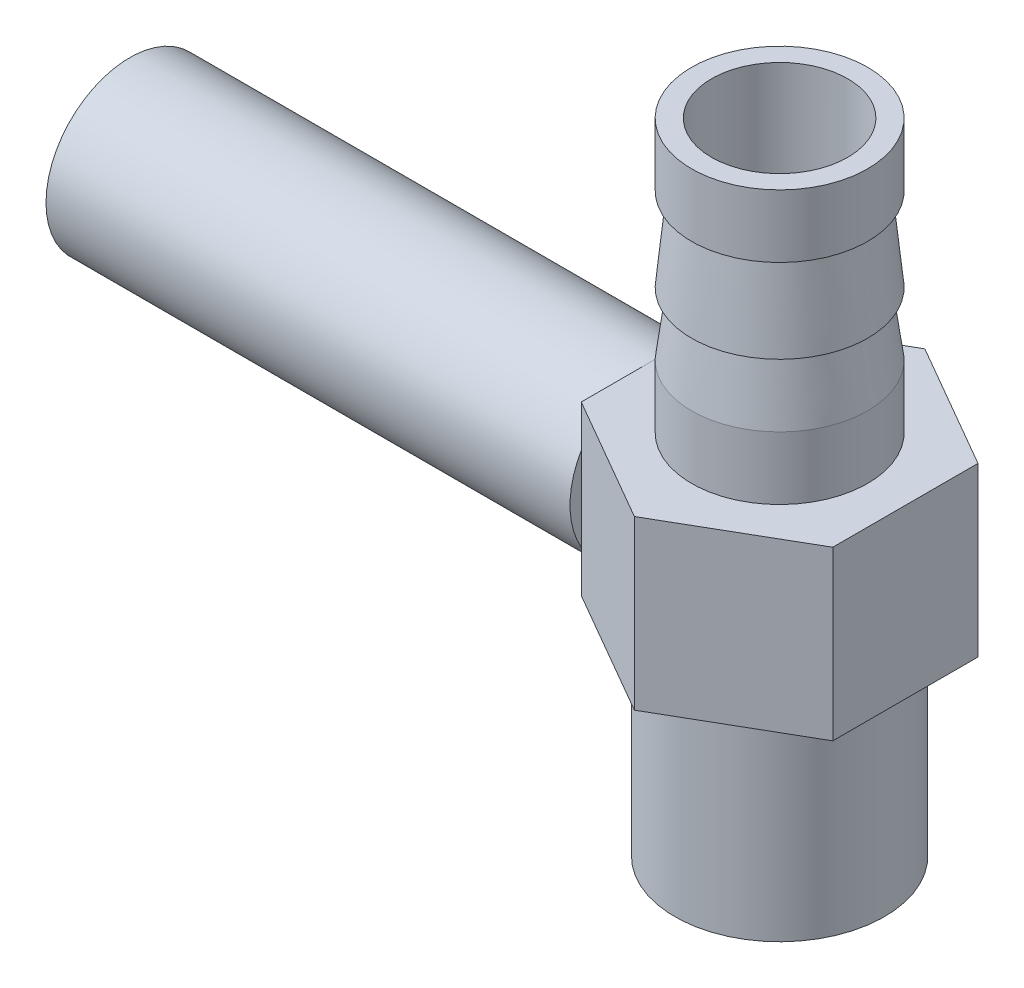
ISO-10303-21;
HEADER;
FILE_DESCRIPTION(('STEP AP214'),'2;1');
FILE_NAME('part.step','',(''),(''),'','','');
FILE_SCHEMA(('AUTOMOTIVE_DESIGN { 1 0 10303 214 1 1 1 1 }'));
ENDSEC;
DATA;
#1=APPLICATION_CONTEXT('core data for automotive mechanical design processes');
#2=APPLICATION_PROTOCOL_DEFINITION('international standard','automotive_design',2000,#1);
#3=PRODUCT_CONTEXT('',#1,'mechanical');
#4=PRODUCT('Part','Part','',(#3));
#5=PRODUCT_RELATED_PRODUCT_CATEGORY('part','',(#4));
#6=PRODUCT_DEFINITION_FORMATION('','',#4);
#7=PRODUCT_DEFINITION_CONTEXT('part definition',#1,'design');
#8=PRODUCT_DEFINITION('design','',#6,#7);
#9=PRODUCT_DEFINITION_SHAPE('','',#8);
#10=(LENGTH_UNIT() NAMED_UNIT(*) SI_UNIT(.MILLI.,.METRE.));
#11=(NAMED_UNIT(*) PLANE_ANGLE_UNIT() SI_UNIT($,.RADIAN.));
#12=(NAMED_UNIT(*) SI_UNIT($,.STERADIAN.) SOLID_ANGLE_UNIT());
#13=UNCERTAINTY_MEASURE_WITH_UNIT(LENGTH_MEASURE(1.E-05),#10,'distance_accuracy_value','');
#14=(GEOMETRIC_REPRESENTATION_CONTEXT(3) GLOBAL_UNCERTAINTY_ASSIGNED_CONTEXT((#13)) GLOBAL_UNIT_ASSIGNED_CONTEXT((#10,
#11,#12)) REPRESENTATION_CONTEXT('',''));
#15=CARTESIAN_POINT('',(0.,0.,0.));
#16=DIRECTION('',(0.,0.,1.));
#17=DIRECTION('',(1.,0.,0.));
#18=AXIS2_PLACEMENT_3D('',#15,#16,#17);
#19=CARTESIAN_POINT('',(-6.,-8.,3.46410161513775));
#20=DIRECTION('',(1.,0.,0.));
#21=DIRECTION('',(0.,0.,-1.));
#22=AXIS2_PLACEMENT_3D('',#19,#20,#21);
#23=PLANE('',#22);
#24=CARTESIAN_POINT('',(-6.,-4.,0.));
#25=DIRECTION('',(-1.,0.,0.));
#26=DIRECTION('',(0.,0.,1.));
#27=AXIS2_PLACEMENT_3D('',#24,#25,#26);
#28=CIRCLE('',#27,4.);
#29=CARTESIAN_POINT('',(-6.,-2.,3.46410161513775));
#30=VERTEX_POINT('',#29);
#31=CARTESIAN_POINT('',(-6.,0.,0.));
#32=VERTEX_POINT('',#31);
#33=EDGE_CURVE('E34',#30,#32,#28,.T.);
#34=ORIENTED_EDGE('',*,*,#33,.F.);
#35=DIRECTION('',(0.,1.,0.));
#36=VECTOR('',#35,1.);
#37=CARTESIAN_POINT('',(-6.,-8.,3.46410161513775));
#38=LINE('',#37,#36);
#39=CARTESIAN_POINT('',(-6.,0.,3.46410161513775));
#40=VERTEX_POINT('',#39);
#41=EDGE_CURVE('E99',#30,#40,#38,.T.);
#42=ORIENTED_EDGE('',*,*,#41,.T.);
#43=DIRECTION('',(0.,0.,-1.));
#44=VECTOR('',#43,1.);
#45=CARTESIAN_POINT('',(-6.,0.,3.46410161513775));
#46=LINE('',#45,#44);
#47=EDGE_CURVE('E225',#40,#32,#46,.T.);
#48=ORIENTED_EDGE('',*,*,#47,.T.);
#49=EDGE_LOOP('',(#34,#42,#48));
#50=FACE_BOUND('',#49,.T.);
#51=ADVANCED_FACE('F16',(#50),#23,.F.);
#52=CARTESIAN_POINT('',(-6.,-2.,-3.46410161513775));
#53=VERTEX_POINT('',#52);
#54=EDGE_CURVE('E11',#32,#53,#28,.T.);
#55=ORIENTED_EDGE('',*,*,#54,.F.);
#56=CARTESIAN_POINT('',(-6.,0.,-3.46410161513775));
#57=VERTEX_POINT('',#56);
#58=EDGE_CURVE('E224',#32,#57,#46,.T.);
#59=ORIENTED_EDGE('',*,*,#58,.T.);
#60=DIRECTION('',(0.,1.,0.));
#61=VECTOR('',#60,1.);
#62=CARTESIAN_POINT('',(-6.,-8.,-3.46410161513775));
#63=LINE('',#62,#61);
#64=EDGE_CURVE('E129',#53,#57,#63,.T.);
#65=ORIENTED_EDGE('',*,*,#64,.F.);
#66=EDGE_LOOP('',(#55,#59,#65));
#67=FACE_BOUND('',#66,.T.);
#68=ADVANCED_FACE('F177',(#67),#23,.F.);
#69=CARTESIAN_POINT('',(-6.,-6.,-3.46410161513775));
#70=VERTEX_POINT('',#69);
#71=CARTESIAN_POINT('',(-6.,-8.,0.));
#72=VERTEX_POINT('',#71);
#73=EDGE_CURVE('E25',#70,#72,#28,.T.);
#74=ORIENTED_EDGE('',*,*,#73,.F.);
#75=CARTESIAN_POINT('',(-6.,-8.,-3.46410161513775));
#76=VERTEX_POINT('',#75);
#77=EDGE_CURVE('E128',#76,#70,#63,.T.);
#78=ORIENTED_EDGE('',*,*,#77,.F.);
#79=DIRECTION('',(0.,0.,-1.));
#80=VECTOR('',#79,1.);
#81=CARTESIAN_POINT('',(-6.,-8.,3.46410161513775));
#82=LINE('',#81,#80);
#83=EDGE_CURVE('E203',#72,#76,#82,.T.);
#84=ORIENTED_EDGE('',*,*,#83,.F.);
#85=EDGE_LOOP('',(#74,#78,#84));
#86=FACE_BOUND('',#85,.T.);
#87=ADVANCED_FACE('F183',(#86),#23,.F.);
#88=CARTESIAN_POINT('',(-6.,-6.,3.46410161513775));
#89=VERTEX_POINT('',#88);
#90=EDGE_CURVE('E42',#72,#89,#28,.T.);
#91=ORIENTED_EDGE('',*,*,#90,.F.);
#92=CARTESIAN_POINT('',(-6.,-8.,3.46410161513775));
#93=VERTEX_POINT('',#92);
#94=EDGE_CURVE('E94',#93,#72,#82,.T.);
#95=ORIENTED_EDGE('',*,*,#94,.F.);
#96=EDGE_CURVE('E90',#93,#89,#38,.T.);
#97=ORIENTED_EDGE('',*,*,#96,.T.);
#98=EDGE_LOOP('',(#91,#95,#97));
#99=FACE_BOUND('',#98,.T.);
#100=ADVANCED_FACE('F92',(#99),#23,.F.);
#101=CARTESIAN_POINT('',(0.,-8.,6.92820323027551));
#102=DIRECTION('',(0.,-1.,0.));
#103=DIRECTION('',(0.,0.,-1.));
#104=AXIS2_PLACEMENT_3D('',#101,#102,#103);
#105=PLANE('',#104);
#106=DIRECTION('',(-0.866025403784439,0.,0.5));
#107=VECTOR('',#106,1.);
#108=CARTESIAN_POINT('',(6.,-8.,3.46410161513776));
#109=LINE('',#108,#107);
#110=CARTESIAN_POINT('',(6.,-8.,3.46410161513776));
#111=VERTEX_POINT('',#110);
#112=CARTESIAN_POINT('',(0.,-8.,6.92820323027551));
#113=VERTEX_POINT('',#112);
#114=EDGE_CURVE('E233',#111,#113,#109,.T.);
#115=ORIENTED_EDGE('',*,*,#114,.T.);
#116=DIRECTION('',(-0.866025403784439,0.,-0.5));
#117=VECTOR('',#116,1.);
#118=CARTESIAN_POINT('',(0.,-8.,6.92820323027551));
#119=LINE('',#118,#117);
#120=EDGE_CURVE('E257',#113,#93,#119,.T.);
#121=ORIENTED_EDGE('',*,*,#120,.T.);
#122=ORIENTED_EDGE('',*,*,#94,.T.);
#123=ORIENTED_EDGE('',*,*,#83,.T.);
#124=DIRECTION('',(0.866025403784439,0.,-0.5));
#125=VECTOR('',#124,1.);
#126=CARTESIAN_POINT('',(-6.,-8.,-3.46410161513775));
#127=LINE('',#126,#125);
#128=CARTESIAN_POINT('',(0.,-8.,-6.92820323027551));
#129=VERTEX_POINT('',#128);
#130=EDGE_CURVE('E206',#76,#129,#127,.T.);
#131=ORIENTED_EDGE('',*,*,#130,.T.);
#132=DIRECTION('',(0.866025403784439,0.,0.5));
#133=VECTOR('',#132,1.);
#134=CARTESIAN_POINT('',(0.,-8.,-6.92820323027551));
#135=LINE('',#134,#133);
#136=CARTESIAN_POINT('',(6.,-8.,-3.46410161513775));
#137=VERTEX_POINT('',#136);
#138=EDGE_CURVE('E209',#129,#137,#135,.T.);
#139=ORIENTED_EDGE('',*,*,#138,.T.);
#140=DIRECTION('',(0.,0.,1.));
#141=VECTOR('',#140,1.);
#142=CARTESIAN_POINT('',(6.,-8.,-3.46410161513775));
#143=LINE('',#142,#141);
#144=EDGE_CURVE('E211',#137,#111,#143,.T.);
#145=ORIENTED_EDGE('',*,*,#144,.T.);
#146=EDGE_LOOP('',(#115,#121,#122,#123,#131,#139,#145));
#147=FACE_BOUND('',#146,.T.);
#148=CARTESIAN_POINT('',(0.,-8.,0.));
#149=DIRECTION('',(0.,-1.,0.));
#150=DIRECTION('',(0.,0.,-1.));
#151=AXIS2_PLACEMENT_3D('',#148,#149,#150);
#152=CIRCLE('',#151,5.);
#153=CARTESIAN_POINT('',(0.,-8.,-5.));
#154=VERTEX_POINT('',#153);
#155=EDGE_CURVE('E260',#154,#154,#152,.T.);
#156=ORIENTED_EDGE('',*,*,#155,.F.);
#157=EDGE_LOOP('',(#156));
#158=FACE_BOUND('',#157,.T.);
#159=ADVANCED_FACE('F188',(#147,#158),#105,.T.);
#160=CARTESIAN_POINT('',(-4.2,13.,0.));
#161=DIRECTION('',(0.,-1.,0.));
#162=DIRECTION('',(0.,0.,-1.));
#163=AXIS2_PLACEMENT_3D('',#160,#161,#162);
#164=PLANE('',#163);
#165=CARTESIAN_POINT('',(0.,13.,0.));
#166=DIRECTION('',(0.,1.,0.));
#167=DIRECTION('',(0.,0.,1.));
#168=AXIS2_PLACEMENT_3D('',#165,#166,#167);
#169=CIRCLE('',#168,3.25);
#170=CARTESIAN_POINT('',(0.,13.,3.25));
#171=VERTEX_POINT('',#170);
#172=EDGE_CURVE('E119',#171,#171,#169,.T.);
#173=ORIENTED_EDGE('',*,*,#172,.F.);
#174=EDGE_LOOP('',(#173));
#175=FACE_BOUND('',#174,.T.);
#176=CARTESIAN_POINT('',(0.,13.,0.));
#177=DIRECTION('',(0.,-1.,0.));
#178=DIRECTION('',(0.,0.,-1.));
#179=AXIS2_PLACEMENT_3D('',#176,#177,#178);
#180=CIRCLE('',#179,4.2);
#181=CARTESIAN_POINT('',(0.,13.,-4.2));
#182=VERTEX_POINT('',#181);
#183=EDGE_CURVE('E155',#182,#182,#180,.T.);
#184=ORIENTED_EDGE('',*,*,#183,.F.);
#185=EDGE_LOOP('',(#184));
#186=FACE_BOUND('',#185,.T.);
#187=ADVANCED_FACE('F194',(#175,#186),#164,.F.);
#188=CARTESIAN_POINT('',(0.,0.,0.));
#189=DIRECTION('',(0.,-1.,0.));
#190=DIRECTION('',(0.,0.,-1.));
#191=AXIS2_PLACEMENT_3D('',#188,#189,#190);
#192=CYLINDRICAL_SURFACE('',#191,4.2);
#193=CARTESIAN_POINT('',(0.,10.,0.));
#194=DIRECTION('',(0.,-1.,0.));
#195=DIRECTION('',(0.,0.,-1.));
#196=AXIS2_PLACEMENT_3D('',#193,#194,#195);
#197=CIRCLE('',#196,4.2);
#198=CARTESIAN_POINT('',(0.,10.,-4.2));
#199=VERTEX_POINT('',#198);
#200=EDGE_CURVE('E152',#199,#199,#197,.T.);
#201=ORIENTED_EDGE('',*,*,#200,.F.);
#202=EDGE_LOOP('',(#201));
#203=FACE_BOUND('',#202,.T.);
#204=ORIENTED_EDGE('',*,*,#183,.T.);
#205=EDGE_LOOP('',(#204));
#206=FACE_BOUND('',#205,.T.);
#207=ADVANCED_FACE('F270',(#203,#206),#192,.T.);
#208=CARTESIAN_POINT('',(-4.2,10.,0.));
#209=DIRECTION('',(0.,1.,0.));
#210=DIRECTION('',(0.,0.,1.));
#211=AXIS2_PLACEMENT_3D('',#208,#209,#210);
#212=PLANE('',#211);
#213=CARTESIAN_POINT('',(0.,10.,0.));
#214=DIRECTION('',(0.,-1.,0.));
#215=DIRECTION('',(0.,0.,-1.));
#216=AXIS2_PLACEMENT_3D('',#213,#214,#215);
#217=CIRCLE('',#216,3.8);
#218=CARTESIAN_POINT('',(0.,10.,-3.8));
#219=VERTEX_POINT('',#218);
#220=EDGE_CURVE('E149',#219,#219,#217,.T.);
#221=ORIENTED_EDGE('',*,*,#220,.F.);
#222=EDGE_LOOP('',(#221));
#223=FACE_BOUND('',#222,.T.);
#224=ORIENTED_EDGE('',*,*,#200,.T.);
#225=EDGE_LOOP('',(#224));
#226=FACE_BOUND('',#225,.T.);
#227=ADVANCED_FACE('F274',(#223,#226),#212,.F.);
#228=CARTESIAN_POINT('',(0.,10.,0.));
#229=DIRECTION('',(0.,-1.,0.));
#230=DIRECTION('',(0.,0.,-1.));
#231=AXIS2_PLACEMENT_3D('',#228,#229,#230);
#232=CONICAL_SURFACE('',#231,3.8,0.099668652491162);
#233=CARTESIAN_POINT('',(0.,6.,0.));
#234=DIRECTION('',(0.,-1.,0.));
#235=DIRECTION('',(0.,0.,-1.));
#236=AXIS2_PLACEMENT_3D('',#233,#234,#235);
#237=CIRCLE('',#236,4.2);
#238=CARTESIAN_POINT('',(0.,6.,-4.2));
#239=VERTEX_POINT('',#238);
#240=EDGE_CURVE('E146',#239,#239,#237,.T.);
#241=ORIENTED_EDGE('',*,*,#240,.F.);
#242=EDGE_LOOP('',(#241));
#243=FACE_BOUND('',#242,.T.);
#244=ORIENTED_EDGE('',*,*,#220,.T.);
#245=EDGE_LOOP('',(#244));
#246=FACE_BOUND('',#245,.T.);
#247=ADVANCED_FACE('F281',(#243,#246),#232,.T.);
#248=CARTESIAN_POINT('',(-3.8,6.,0.));
#249=DIRECTION('',(0.,1.,0.));
#250=DIRECTION('',(0.,0.,1.));
#251=AXIS2_PLACEMENT_3D('',#248,#249,#250);
#252=PLANE('',#251);
#253=CARTESIAN_POINT('',(0.,6.,0.));
#254=DIRECTION('',(0.,-1.,0.));
#255=DIRECTION('',(0.,0.,-1.));
#256=AXIS2_PLACEMENT_3D('',#253,#254,#255);
#257=CIRCLE('',#256,3.8);
#258=CARTESIAN_POINT('',(0.,6.,-3.8));
#259=VERTEX_POINT('',#258);
#260=EDGE_CURVE('E143',#259,#259,#257,.T.);
#261=ORIENTED_EDGE('',*,*,#260,.F.);
#262=EDGE_LOOP('',(#261));
#263=FACE_BOUND('',#262,.T.);
#264=ORIENTED_EDGE('',*,*,#240,.T.);
#265=EDGE_LOOP('',(#264));
#266=FACE_BOUND('',#265,.T.);
#267=ADVANCED_FACE('F288',(#263,#266),#252,.F.);
#268=CARTESIAN_POINT('',(0.,6.,0.));
#269=DIRECTION('',(0.,-1.,0.));
#270=DIRECTION('',(0.,0.,-1.));
#271=AXIS2_PLACEMENT_3D('',#268,#269,#270);
#272=CONICAL_SURFACE('',#271,3.8,0.132551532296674);
#273=CARTESIAN_POINT('',(0.,3.,0.));
#274=DIRECTION('',(0.,-1.,0.));
#275=DIRECTION('',(0.,0.,-1.));
#276=AXIS2_PLACEMENT_3D('',#273,#274,#275);
#277=CIRCLE('',#276,4.2);
#278=CARTESIAN_POINT('',(0.,3.,-4.2));
#279=VERTEX_POINT('',#278);
#280=EDGE_CURVE('E140',#279,#279,#277,.T.);
#281=ORIENTED_EDGE('',*,*,#280,.F.);
#282=EDGE_LOOP('',(#281));
#283=FACE_BOUND('',#282,.T.);
#284=ORIENTED_EDGE('',*,*,#260,.T.);
#285=EDGE_LOOP('',(#284));
#286=FACE_BOUND('',#285,.T.);
#287=ADVANCED_FACE('F292',(#283,#286),#272,.T.);
#288=CARTESIAN_POINT('',(0.,0.,0.));
#289=DIRECTION('',(0.,-1.,0.));
#290=DIRECTION('',(0.,0.,-1.));
#291=AXIS2_PLACEMENT_3D('',#288,#289,#290);
#292=CYLINDRICAL_SURFACE('',#291,4.2);
#293=CARTESIAN_POINT('',(0.,0.,0.));
#294=DIRECTION('',(0.,-1.,0.));
#295=DIRECTION('',(0.,0.,-1.));
#296=AXIS2_PLACEMENT_3D('',#293,#294,#295);
#297=CIRCLE('',#296,4.2);
#298=CARTESIAN_POINT('',(0.,0.,-4.2));
#299=VERTEX_POINT('',#298);
#300=EDGE_CURVE('E137',#299,#299,#297,.T.);
#301=ORIENTED_EDGE('',*,*,#300,.F.);
#302=EDGE_LOOP('',(#301));
#303=FACE_BOUND('',#302,.T.);
#304=ORIENTED_EDGE('',*,*,#280,.T.);
#305=EDGE_LOOP('',(#304));
#306=FACE_BOUND('',#305,.T.);
#307=ADVANCED_FACE('F296',(#303,#306),#292,.T.);
#308=CARTESIAN_POINT('',(0.,0.,6.92820323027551));
#309=DIRECTION('',(0.,-1.,0.));
#310=DIRECTION('',(0.,0.,-1.));
#311=AXIS2_PLACEMENT_3D('',#308,#309,#310);
#312=PLANE('',#311);
#313=DIRECTION('',(-0.866025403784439,0.,0.5));
#314=VECTOR('',#313,1.);
#315=CARTESIAN_POINT('',(6.,0.,3.46410161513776));
#316=LINE('',#315,#314);
#317=CARTESIAN_POINT('',(6.,0.,3.46410161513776));
#318=VERTEX_POINT('',#317);
#319=CARTESIAN_POINT('',(0.,0.,6.92820323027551));
#320=VERTEX_POINT('',#319);
#321=EDGE_CURVE('E218',#318,#320,#316,.T.);
#322=ORIENTED_EDGE('',*,*,#321,.F.);
#323=DIRECTION('',(0.,0.,1.));
#324=VECTOR('',#323,1.);
#325=CARTESIAN_POINT('',(6.,0.,-3.46410161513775));
#326=LINE('',#325,#324);
#327=CARTESIAN_POINT('',(6.,0.,-3.46410161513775));
#328=VERTEX_POINT('',#327);
#329=EDGE_CURVE('E231',#328,#318,#326,.T.);
#330=ORIENTED_EDGE('',*,*,#329,.F.);
#331=DIRECTION('',(0.866025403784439,0.,0.5));
#332=VECTOR('',#331,1.);
#333=CARTESIAN_POINT('',(0.,0.,-6.92820323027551));
#334=LINE('',#333,#332);
#335=CARTESIAN_POINT('',(0.,0.,-6.92820323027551));
#336=VERTEX_POINT('',#335);
#337=EDGE_CURVE('E229',#336,#328,#334,.T.);
#338=ORIENTED_EDGE('',*,*,#337,.F.);
#339=DIRECTION('',(0.866025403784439,0.,-0.5));
#340=VECTOR('',#339,1.);
#341=CARTESIAN_POINT('',(-6.,0.,-3.46410161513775));
#342=LINE('',#341,#340);
#343=EDGE_CURVE('E227',#57,#336,#342,.T.);
#344=ORIENTED_EDGE('',*,*,#343,.F.);
#345=ORIENTED_EDGE('',*,*,#58,.F.);
#346=ORIENTED_EDGE('',*,*,#47,.F.);
#347=DIRECTION('',(-0.866025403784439,0.,-0.5));
#348=VECTOR('',#347,1.);
#349=CARTESIAN_POINT('',(0.,0.,6.92820323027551));
#350=LINE('',#349,#348);
#351=EDGE_CURVE('E221',#320,#40,#350,.T.);
#352=ORIENTED_EDGE('',*,*,#351,.F.);
#353=EDGE_LOOP('',(#322,#330,#338,#344,#345,#346,#352));
#354=FACE_BOUND('',#353,.T.);
#355=ORIENTED_EDGE('',*,*,#300,.T.);
#356=EDGE_LOOP('',(#355));
#357=FACE_BOUND('',#356,.T.);
#358=ADVANCED_FACE('F247',(#354,#357),#312,.F.);
#359=CARTESIAN_POINT('',(6.,-8.,3.46410161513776));
#360=DIRECTION('',(-0.5,0.,-0.866025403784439));
#361=DIRECTION('',(-0.866025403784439,0.,0.5));
#362=AXIS2_PLACEMENT_3D('',#359,#360,#361);
#363=PLANE('',#362);
#364=ORIENTED_EDGE('',*,*,#321,.T.);
#365=DIRECTION('',(0.,1.,0.));
#366=VECTOR('',#365,1.);
#367=CARTESIAN_POINT('',(0.,-8.,6.92820323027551));
#368=LINE('',#367,#366);
#369=EDGE_CURVE('E96',#113,#320,#368,.T.);
#370=ORIENTED_EDGE('',*,*,#369,.F.);
#371=ORIENTED_EDGE('',*,*,#114,.F.);
#372=DIRECTION('',(0.,1.,0.));
#373=VECTOR('',#372,1.);
#374=CARTESIAN_POINT('',(6.,-8.,3.46410161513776));
#375=LINE('',#374,#373);
#376=EDGE_CURVE('E217',#111,#318,#375,.T.);
#377=ORIENTED_EDGE('',*,*,#376,.T.);
#378=EDGE_LOOP('',(#364,#370,#371,#377));
#379=FACE_BOUND('',#378,.T.);
#380=ADVANCED_FACE('F254',(#379),#363,.F.);
#381=CARTESIAN_POINT('',(0.,-8.,6.92820323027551));
#382=DIRECTION('',(0.5,0.,-0.866025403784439));
#383=DIRECTION('',(-0.866025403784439,0.,-0.5));
#384=AXIS2_PLACEMENT_3D('',#381,#382,#383);
#385=PLANE('',#384);
#386=ORIENTED_EDGE('',*,*,#351,.T.);
#387=ORIENTED_EDGE('',*,*,#41,.F.);
#388=EDGE_CURVE('E97',#89,#30,#38,.T.);
#389=ORIENTED_EDGE('',*,*,#388,.F.);
#390=ORIENTED_EDGE('',*,*,#96,.F.);
#391=ORIENTED_EDGE('',*,*,#120,.F.);
#392=ORIENTED_EDGE('',*,*,#369,.T.);
#393=EDGE_LOOP('',(#386,#387,#389,#390,#391,#392));
#394=FACE_BOUND('',#393,.T.);
#395=ADVANCED_FACE('F103',(#394),#385,.F.);
#396=CARTESIAN_POINT('',(-6.,-8.,-3.46410161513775));
#397=DIRECTION('',(0.5,0.,0.866025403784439));
#398=DIRECTION('',(0.866025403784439,0.,-0.5));
#399=AXIS2_PLACEMENT_3D('',#396,#397,#398);
#400=PLANE('',#399);
#401=ORIENTED_EDGE('',*,*,#343,.T.);
#402=DIRECTION('',(0.,1.,0.));
#403=VECTOR('',#402,1.);
#404=CARTESIAN_POINT('',(0.,-8.,-6.92820323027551));
#405=LINE('',#404,#403);
#406=EDGE_CURVE('E131',#129,#336,#405,.T.);
#407=ORIENTED_EDGE('',*,*,#406,.F.);
#408=ORIENTED_EDGE('',*,*,#130,.F.);
#409=ORIENTED_EDGE('',*,*,#77,.T.);
#410=EDGE_CURVE('E125',#70,#53,#63,.T.);
#411=ORIENTED_EDGE('',*,*,#410,.T.);
#412=ORIENTED_EDGE('',*,*,#64,.T.);
#413=EDGE_LOOP('',(#401,#407,#408,#409,#411,#412));
#414=FACE_BOUND('',#413,.T.);
#415=ADVANCED_FACE('F204',(#414),#400,.F.);
#416=CARTESIAN_POINT('',(0.,-8.,-6.92820323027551));
#417=DIRECTION('',(-0.5,0.,0.866025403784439));
#418=DIRECTION('',(0.866025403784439,0.,0.5));
#419=AXIS2_PLACEMENT_3D('',#416,#417,#418);
#420=PLANE('',#419);
#421=ORIENTED_EDGE('',*,*,#337,.T.);
#422=DIRECTION('',(0.,1.,0.));
#423=VECTOR('',#422,1.);
#424=CARTESIAN_POINT('',(6.,-8.,-3.46410161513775));
#425=LINE('',#424,#423);
#426=EDGE_CURVE('E235',#137,#328,#425,.T.);
#427=ORIENTED_EDGE('',*,*,#426,.F.);
#428=ORIENTED_EDGE('',*,*,#138,.F.);
#429=ORIENTED_EDGE('',*,*,#406,.T.);
#430=EDGE_LOOP('',(#421,#427,#428,#429));
#431=FACE_BOUND('',#430,.T.);
#432=ADVANCED_FACE('F243',(#431),#420,.F.);
#433=CARTESIAN_POINT('',(6.,-8.,-3.46410161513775));
#434=DIRECTION('',(-1.,0.,0.));
#435=DIRECTION('',(0.,0.,1.));
#436=AXIS2_PLACEMENT_3D('',#433,#434,#435);
#437=PLANE('',#436);
#438=ORIENTED_EDGE('',*,*,#329,.T.);
#439=ORIENTED_EDGE('',*,*,#376,.F.);
#440=ORIENTED_EDGE('',*,*,#144,.F.);
#441=ORIENTED_EDGE('',*,*,#426,.T.);
#442=EDGE_LOOP('',(#438,#439,#440,#441));
#443=FACE_BOUND('',#442,.T.);
#444=ADVANCED_FACE('F251',(#443),#437,.F.);
#445=CARTESIAN_POINT('',(0.,-17.5,0.));
#446=DIRECTION('',(0.,1.,0.));
#447=DIRECTION('',(0.,0.,1.));
#448=AXIS2_PLACEMENT_3D('',#445,#446,#447);
#449=CYLINDRICAL_SURFACE('',#448,5.);
#450=CARTESIAN_POINT('',(0.,-17.5,0.));
#451=DIRECTION('',(0.,-1.,0.));
#452=DIRECTION('',(0.,0.,-1.));
#453=AXIS2_PLACEMENT_3D('',#450,#451,#452);
#454=CIRCLE('',#453,5.);
#455=CARTESIAN_POINT('',(0.,-17.5,-5.));
#456=VERTEX_POINT('',#455);
#457=EDGE_CURVE('E222',#456,#456,#454,.T.);
#458=ORIENTED_EDGE('',*,*,#457,.F.);
#459=EDGE_LOOP('',(#458));
#460=FACE_BOUND('',#459,.T.);
#461=ORIENTED_EDGE('',*,*,#155,.T.);
#462=EDGE_LOOP('',(#461));
#463=FACE_BOUND('',#462,.T.);
#464=ADVANCED_FACE('F315',(#460,#463),#449,.T.);
#465=CARTESIAN_POINT('',(0.,-17.5,0.));
#466=DIRECTION('',(0.,-1.,0.));
#467=DIRECTION('',(0.,0.,-1.));
#468=AXIS2_PLACEMENT_3D('',#465,#466,#467);
#469=PLANE('',#468);
#470=CARTESIAN_POINT('',(0.,-17.5,0.));
#471=DIRECTION('',(0.,-1.,0.));
#472=DIRECTION('',(0.,0.,-1.));
#473=AXIS2_PLACEMENT_3D('',#470,#471,#472);
#474=CIRCLE('',#473,3.75);
#475=CARTESIAN_POINT('',(0.,-17.5,-3.75));
#476=VERTEX_POINT('',#475);
#477=EDGE_CURVE('E114',#476,#476,#474,.F.);
#478=ORIENTED_EDGE('',*,*,#477,.T.);
#479=EDGE_LOOP('',(#478));
#480=FACE_BOUND('',#479,.T.);
#481=ORIENTED_EDGE('',*,*,#457,.T.);
#482=EDGE_LOOP('',(#481));
#483=FACE_BOUND('',#482,.T.);
#484=ADVANCED_FACE('F160',(#480,#483),#469,.T.);
#485=CARTESIAN_POINT('',(0.,-17.5,0.));
#486=DIRECTION('',(0.,1.,0.));
#487=DIRECTION('',(0.,0.,1.));
#488=AXIS2_PLACEMENT_3D('',#485,#486,#487);
#489=CYLINDRICAL_SURFACE('',#488,3.25);
#490=CARTESIAN_POINT('',(-2.4804233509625,-4.,2.1));
#491=CARTESIAN_POINT('',(-2.48043845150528,-3.89652461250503,2.09999091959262));
#492=CARTESIAN_POINT('',(-2.48701795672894,-3.79297509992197,2.09228589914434));
#493=CARTESIAN_POINT('',(-2.51211593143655,-3.58949761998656,2.06206847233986));
#494=CARTESIAN_POINT('',(-2.5306567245,-3.48957679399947,2.03952837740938));
#495=CARTESIAN_POINT('',(-2.57646364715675,-3.29688347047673,1.98133246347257));
#496=CARTESIAN_POINT('',(-2.60365080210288,-3.20405535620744,1.94579493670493));
#497=CARTESIAN_POINT('',(-2.66354983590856,-3.02580268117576,1.86295780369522));
#498=CARTESIAN_POINT('',(-2.6962629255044,-2.94037974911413,1.81565561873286));
#499=CARTESIAN_POINT('',(-2.76921635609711,-2.7658067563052,1.70267020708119));
#500=CARTESIAN_POINT('',(-2.8098609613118,-2.67790575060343,1.63531771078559));
#501=CARTESIAN_POINT('',(-2.89081899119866,-2.5135800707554,1.48754125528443));
#502=CARTESIAN_POINT('',(-2.93113208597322,-2.43716576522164,1.40710562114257));
#503=CARTESIAN_POINT('',(-3.01318195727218,-2.28794039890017,1.22258717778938));
#504=CARTESIAN_POINT('',(-3.05440149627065,-2.21694349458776,1.11678374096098));
#505=CARTESIAN_POINT('',(-3.12755287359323,-2.09434943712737,0.891558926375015));
#506=CARTESIAN_POINT('',(-3.15949445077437,-2.04273192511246,0.772152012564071));
#507=CARTESIAN_POINT('',(-3.20740615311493,-1.96634890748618,0.53657275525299));
#508=CARTESIAN_POINT('',(-3.22471932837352,-1.93930154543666,0.42142092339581));
#509=CARTESIAN_POINT('',(-3.24673656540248,-1.90501062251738,0.187067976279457));
#510=CARTESIAN_POINT('',(-3.25145516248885,-1.89774423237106,0.0678716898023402));
#511=CARTESIAN_POINT('',(-3.24801233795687,-1.90307943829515,-0.152710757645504));
#512=CARTESIAN_POINT('',(-3.24159791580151,-1.91298596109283,-0.254203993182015));
#513=CARTESIAN_POINT('',(-3.21973471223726,-1.94710832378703,-0.453737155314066));
#514=CARTESIAN_POINT('',(-3.20428525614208,-1.9713252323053,-0.551776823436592));
#515=CARTESIAN_POINT('',(-3.16567266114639,-2.03288149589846,-0.741914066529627));
#516=CARTESIAN_POINT('',(-3.14251385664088,-2.070213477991,-0.834014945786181));
#517=CARTESIAN_POINT('',(-3.09023059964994,-2.15657787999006,-1.01067921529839));
#518=CARTESIAN_POINT('',(-3.06110493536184,-2.20561267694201,-1.09524106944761));
#519=CARTESIAN_POINT('',(-2.99482921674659,-2.32100671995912,-1.26606840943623));
#520=CARTESIAN_POINT('',(-2.95712912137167,-2.38878107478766,-1.35116245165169));
#521=CARTESIAN_POINT('',(-2.87952421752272,-2.53607304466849,-1.50951541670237));
#522=CARTESIAN_POINT('',(-2.83961613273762,-2.61560842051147,-1.58275608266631));
#523=CARTESIAN_POINT('',(-2.75520877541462,-2.79746487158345,-1.72602812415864));
#524=CARTESIAN_POINT('',(-2.71087011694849,-2.90141788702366,-1.7940990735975));
#525=CARTESIAN_POINT('',(-2.62930146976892,-3.12185936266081,-1.91164880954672));
#526=CARTESIAN_POINT('',(-2.592058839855,-3.23832494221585,-1.96116081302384));
#527=CARTESIAN_POINT('',(-2.53965451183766,-3.44807702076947,-2.02828693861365));
#528=CARTESIAN_POINT('',(-2.52123720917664,-3.53893459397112,-2.05092811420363));
#529=CARTESIAN_POINT('',(-2.49403574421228,-3.72420522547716,-2.0839282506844));
#530=CARTESIAN_POINT('',(-2.48523665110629,-3.81861253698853,-2.09430625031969));
#531=CARTESIAN_POINT('',(-2.47861576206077,-4.00867147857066,-2.10214096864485));
#532=CARTESIAN_POINT('',(-2.48082955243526,-4.10432614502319,-2.0995557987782));
#533=CARTESIAN_POINT('',(-2.49595005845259,-4.29358758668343,-2.08155227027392));
#534=CARTESIAN_POINT('',(-2.50886571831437,-4.3871925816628,-2.06612317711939));
#535=CARTESIAN_POINT('',(-2.54290534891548,-4.56695469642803,-2.02406152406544));
#536=CARTESIAN_POINT('',(-2.56375507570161,-4.65325402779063,-1.99780105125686));
#537=CARTESIAN_POINT('',(-2.61133107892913,-4.82035266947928,-1.93519822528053));
#538=CARTESIAN_POINT('',(-2.63805929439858,-4.90115015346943,-1.89885254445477));
#539=CARTESIAN_POINT('',(-2.70071587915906,-5.07184920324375,-1.80891939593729));
#540=CARTESIAN_POINT('',(-2.73741997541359,-5.16041879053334,-1.75334715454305));
#541=CARTESIAN_POINT('',(-2.81255143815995,-5.32799088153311,-1.63011517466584));
#542=CARTESIAN_POINT('',(-2.85098083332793,-5.40698169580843,-1.56244091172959));
#543=CARTESIAN_POINT('',(-2.93372484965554,-5.56841147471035,-1.40191748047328));
#544=CARTESIAN_POINT('',(-2.97777948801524,-5.64868187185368,-1.30672762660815));
#545=CARTESIAN_POINT('',(-3.05951495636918,-5.79209191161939,-1.10181464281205));
#546=CARTESIAN_POINT('',(-3.097202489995,-5.85524961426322,-0.992107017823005));
#547=CARTESIAN_POINT('',(-3.15559465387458,-5.95100147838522,-0.783588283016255));
#548=CARTESIAN_POINT('',(-3.17818624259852,-5.98717619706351,-0.686950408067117));
#549=CARTESIAN_POINT('',(-3.21475542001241,-6.04515601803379,-0.487909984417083));
#550=CARTESIAN_POINT('',(-3.2287400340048,-6.06697284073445,-0.385512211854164));
#551=CARTESIAN_POINT('',(-3.24684337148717,-6.09513965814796,-0.177355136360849));
#552=CARTESIAN_POINT('',(-3.25092723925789,-6.10143501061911,-0.0715852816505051));
#553=CARTESIAN_POINT('',(-3.24871699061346,-6.09801437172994,0.139591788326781));
#554=CARTESIAN_POINT('',(-3.24242245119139,-6.08829772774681,0.244998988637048));
#555=CARTESIAN_POINT('',(-3.22071854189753,-6.05442995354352,0.446261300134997));
#556=CARTESIAN_POINT('',(-3.20584289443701,-6.03112324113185,0.542319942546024));
#557=CARTESIAN_POINT('',(-3.16863756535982,-5.97187577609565,0.7288994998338));
#558=CARTESIAN_POINT('',(-3.1463066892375,-5.93593299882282,0.819419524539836));
#559=CARTESIAN_POINT('',(-3.09399061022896,-5.84973951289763,0.999572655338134));
#560=CARTESIAN_POINT('',(-3.06357002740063,-5.79864489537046,1.08867254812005));
#561=CARTESIAN_POINT('',(-2.99825879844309,-5.68499812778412,1.25743727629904));
#562=CARTESIAN_POINT('',(-2.96336482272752,-5.62243742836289,1.33709499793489));
#563=CARTESIAN_POINT('',(-2.88593888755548,-5.47666513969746,1.49765485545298));
#564=CARTESIAN_POINT('',(-2.84305935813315,-5.39175650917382,1.57685099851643));
#565=CARTESIAN_POINT('',(-2.75849016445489,-5.20965792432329,1.72051809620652));
#566=CARTESIAN_POINT('',(-2.71680100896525,-5.11246281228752,1.78498283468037));
#567=CARTESIAN_POINT('',(-2.64425153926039,-4.9200315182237,1.89050220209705));
#568=CARTESIAN_POINT('',(-2.61268824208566,-4.82612736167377,1.9334942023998));
#569=CARTESIAN_POINT('',(-2.55772669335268,-4.6309899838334,2.00564393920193));
#570=CARTESIAN_POINT('',(-2.53430834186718,-4.52977555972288,2.03483579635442));
#571=CARTESIAN_POINT('',(-2.50498927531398,-4.35659717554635,2.07071740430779));
#572=CARTESIAN_POINT('',(-2.49585570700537,-4.28604522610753,2.08165746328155));
#573=CARTESIAN_POINT('',(-2.48356781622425,-4.14367400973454,2.0963015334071));
#574=CARTESIAN_POINT('',(-2.48041286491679,-4.07185487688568,2.10000630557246));
#575=CARTESIAN_POINT('',(-2.4804233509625,-4.,2.1));
#576=B_SPLINE_CURVE_WITH_KNOTS('',3,(#490,#491,#492,#493,#494,#495,#496,#497,#498,#499,#500,
#501,#502,#503,#504,#505,#506,#507,#508,#509,#510,#511,#512,#513,#514,#515,#516,#517,#518,#519,
#520,#521,#522,#523,#524,#525,#526,#527,#528,#529,#530,#531,#532,#533,#534,#535,#536,#537,#538,
#539,#540,#541,#542,#543,#544,#545,#546,#547,#548,#549,#550,#551,#552,#553,#554,#555,#556,#557,
#558,#559,#560,#561,#562,#563,#564,#565,#566,#567,#568,#569,#570,#571,#572,#573,#574,#575),
.UNSPECIFIED.,.T.,.F.,(4,2,2,2,2,2,2,2,2,2,2,2,2,2,2,2,2,2,2,2,2,2,2,2,2,2,2,2,2,2,2,2,2,2,2,2,
2,2,2,2,2,2,4),(0.,0.310100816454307,0.620782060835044,0.928703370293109,1.2366922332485,
1.58924382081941,1.94211175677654,2.34166331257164,2.7407939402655,3.09722615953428,
3.45324684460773,3.75830570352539,4.06338734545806,4.36829775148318,4.67327014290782,
5.01734083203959,5.36193652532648,5.75586357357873,6.14908216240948,6.43420929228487,
6.71889317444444,7.00449756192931,7.29034088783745,7.56708936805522,7.84392927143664,
8.17518236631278,8.5068357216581,8.90115444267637,9.29505538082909,9.61060478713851,
9.92589628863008,10.2422961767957,10.5587089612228,10.8572881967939,11.1559152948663,
11.4760456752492,11.7964157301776,12.1662391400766,12.5362183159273,12.8589966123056,
13.1809726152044,13.3963339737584,13.6116726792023),.UNSPECIFIED.);
#577=CARTESIAN_POINT('',(-2.4804233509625,-4.,2.1));
#578=VERTEX_POINT('',#577);
#579=EDGE_CURVE('E109',#578,#578,#576,.T.);
#580=ORIENTED_EDGE('',*,*,#579,.T.);
#581=EDGE_LOOP('',(#580));
#582=FACE_BOUND('',#581,.T.);
#583=CARTESIAN_POINT('',(0.,-17.,0.));
#584=DIRECTION('',(0.,-1.,0.));
#585=DIRECTION('',(0.,0.,-1.));
#586=AXIS2_PLACEMENT_3D('',#583,#584,#585);
#587=CIRCLE('',#586,3.25);
#588=CARTESIAN_POINT('',(0.,-17.,-3.25));
#589=VERTEX_POINT('',#588);
#590=EDGE_CURVE('E20',#589,#589,#587,.T.);
#591=ORIENTED_EDGE('',*,*,#590,.T.);
#592=EDGE_LOOP('',(#591));
#593=FACE_BOUND('',#592,.T.);
#594=ORIENTED_EDGE('',*,*,#172,.T.);
#595=EDGE_LOOP('',(#594));
#596=FACE_BOUND('',#595,.T.);
#597=ADVANCED_FACE('F164',(#582,#593,#596),#489,.F.);
#598=CARTESIAN_POINT('',(0.,-17.5,0.));
#599=DIRECTION('',(0.,-1.,0.));
#600=DIRECTION('',(0.,0.,-1.));
#601=AXIS2_PLACEMENT_3D('',#598,#599,#600);
#602=CONICAL_SURFACE('',#601,3.75,0.785398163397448);
#603=ORIENTED_EDGE('',*,*,#590,.F.);
#604=EDGE_LOOP('',(#603));
#605=FACE_BOUND('',#604,.T.);
#606=ORIENTED_EDGE('',*,*,#477,.F.);
#607=EDGE_LOOP('',(#606));
#608=FACE_BOUND('',#607,.T.);
#609=ADVANCED_FACE('F18',(#605,#608),#602,.F.);
#610=CARTESIAN_POINT('',(-6.,-4.,0.));
#611=DIRECTION('',(-1.,0.,0.));
#612=DIRECTION('',(0.,0.,1.));
#613=AXIS2_PLACEMENT_3D('',#610,#611,#612);
#614=PLANE('',#613);
#615=EDGE_CURVE('E106',#89,#30,#28,.T.);
#616=ORIENTED_EDGE('',*,*,#615,.F.);
#617=ORIENTED_EDGE('',*,*,#388,.T.);
#618=EDGE_LOOP('',(#616,#617));
#619=FACE_BOUND('',#618,.T.);
#620=ADVANCED_FACE('F107',(#619),#614,.F.);
#621=CARTESIAN_POINT('',(-31.,-4.,0.));
#622=DIRECTION('',(1.,0.,0.));
#623=DIRECTION('',(0.,0.,-1.));
#624=AXIS2_PLACEMENT_3D('',#621,#622,#623);
#625=CYLINDRICAL_SURFACE('',#624,4.);
#626=CARTESIAN_POINT('',(-31.,-4.,0.));
#627=DIRECTION('',(-1.,0.,0.));
#628=DIRECTION('',(0.,0.,1.));
#629=AXIS2_PLACEMENT_3D('',#626,#627,#628);
#630=CIRCLE('',#629,4.);
#631=CARTESIAN_POINT('',(-31.,-4.,3.99999999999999));
#632=VERTEX_POINT('',#631);
#633=EDGE_CURVE('E117',#632,#632,#630,.T.);
#634=ORIENTED_EDGE('',*,*,#633,.F.);
#635=EDGE_LOOP('',(#634));
#636=FACE_BOUND('',#635,.T.);
#637=ORIENTED_EDGE('',*,*,#33,.T.);
#638=ORIENTED_EDGE('',*,*,#54,.T.);
#639=EDGE_CURVE('E27',#53,#70,#28,.T.);
#640=ORIENTED_EDGE('',*,*,#639,.T.);
#641=ORIENTED_EDGE('',*,*,#73,.T.);
#642=ORIENTED_EDGE('',*,*,#90,.T.);
#643=ORIENTED_EDGE('',*,*,#615,.T.);
#644=EDGE_LOOP('',(#637,#638,#640,#641,#642,#643));
#645=FACE_BOUND('',#644,.T.);
#646=ADVANCED_FACE('F111',(#636,#645),#625,.T.);
#647=CARTESIAN_POINT('',(-31.,-4.,0.));
#648=DIRECTION('',(-1.,0.,0.));
#649=DIRECTION('',(0.,0.,1.));
#650=AXIS2_PLACEMENT_3D('',#647,#648,#649);
#651=PLANE('',#650);
#652=CARTESIAN_POINT('',(-31.,-4.,0.));
#653=DIRECTION('',(-1.,0.,0.));
#654=DIRECTION('',(0.,0.,1.));
#655=AXIS2_PLACEMENT_3D('',#652,#653,#654);
#656=CIRCLE('',#655,2.1);
#657=CARTESIAN_POINT('',(-31.,-4.,2.09999999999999));
#658=VERTEX_POINT('',#657);
#659=EDGE_CURVE('E331',#658,#658,#656,.T.);
#660=ORIENTED_EDGE('',*,*,#659,.F.);
#661=EDGE_LOOP('',(#660));
#662=FACE_BOUND('',#661,.T.);
#663=ORIENTED_EDGE('',*,*,#633,.T.);
#664=EDGE_LOOP('',(#663));
#665=FACE_BOUND('',#664,.T.);
#666=ADVANCED_FACE('F337',(#662,#665),#651,.T.);
#667=ORIENTED_EDGE('',*,*,#410,.F.);
#668=ORIENTED_EDGE('',*,*,#639,.F.);
#669=EDGE_LOOP('',(#667,#668));
#670=FACE_BOUND('',#669,.T.);
#671=ADVANCED_FACE('F123',(#670),#614,.F.);
#672=CARTESIAN_POINT('',(0.,-4.,0.));
#673=DIRECTION('',(-1.,0.,0.));
#674=DIRECTION('',(0.,0.,1.));
#675=AXIS2_PLACEMENT_3D('',#672,#673,#674);
#676=CYLINDRICAL_SURFACE('',#675,2.1);
#677=ORIENTED_EDGE('',*,*,#659,.T.);
#678=EDGE_LOOP('',(#677));
#679=FACE_BOUND('',#678,.T.);
#680=ORIENTED_EDGE('',*,*,#579,.F.);
#681=EDGE_LOOP('',(#680));
#682=FACE_BOUND('',#681,.T.);
#683=ADVANCED_FACE('F332',(#679,#682),#676,.F.);
#684=CLOSED_SHELL('',(#51,#68,#87,#100,#159,#187,#207,#227,#247,#267,#287,#307,#358,#380,#395,
#415,#432,#444,#464,#484,#597,#609,#620,#646,#666,#671,#683));
#685=MANIFOLD_SOLID_BREP('B1',#684);
#686=ADVANCED_BREP_SHAPE_REPRESENTATION('',(#18,#685),#14);
#687=SHAPE_DEFINITION_REPRESENTATION(#9,#686);
ENDSEC;
END-ISO-10303-21;
